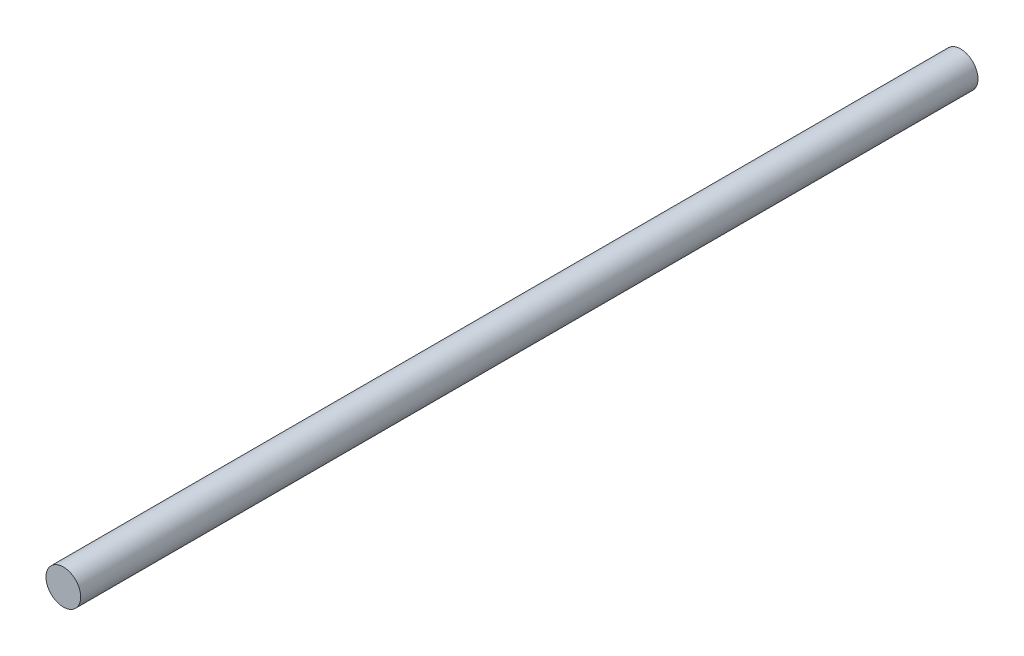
ISO-10303-21;
HEADER;
FILE_DESCRIPTION(('STEP AP214'),'2;1');
FILE_NAME('part.step','',(''),(''),'','','');
FILE_SCHEMA(('AUTOMOTIVE_DESIGN { 1 0 10303 214 1 1 1 1 }'));
ENDSEC;
DATA;
#1=APPLICATION_CONTEXT('core data for automotive mechanical design processes');
#2=APPLICATION_PROTOCOL_DEFINITION('international standard','automotive_design',2000,#1);
#3=PRODUCT_CONTEXT('',#1,'mechanical');
#4=PRODUCT('Part','Part','',(#3));
#5=PRODUCT_RELATED_PRODUCT_CATEGORY('part','',(#4));
#6=PRODUCT_DEFINITION_FORMATION('','',#4);
#7=PRODUCT_DEFINITION_CONTEXT('part definition',#1,'design');
#8=PRODUCT_DEFINITION('design','',#6,#7);
#9=PRODUCT_DEFINITION_SHAPE('','',#8);
#10=(LENGTH_UNIT() NAMED_UNIT(*) SI_UNIT(.MILLI.,.METRE.));
#11=(NAMED_UNIT(*) PLANE_ANGLE_UNIT() SI_UNIT($,.RADIAN.));
#12=(NAMED_UNIT(*) SI_UNIT($,.STERADIAN.) SOLID_ANGLE_UNIT());
#13=UNCERTAINTY_MEASURE_WITH_UNIT(LENGTH_MEASURE(1.E-05),#10,'distance_accuracy_value','');
#14=(GEOMETRIC_REPRESENTATION_CONTEXT(3) GLOBAL_UNCERTAINTY_ASSIGNED_CONTEXT((#13)) GLOBAL_UNIT_ASSIGNED_CONTEXT((#10,
#11,#12)) REPRESENTATION_CONTEXT('',''));
#15=CARTESIAN_POINT('',(0.,0.,0.));
#16=DIRECTION('',(0.,0.,1.));
#17=DIRECTION('',(1.,0.,0.));
#18=AXIS2_PLACEMENT_3D('',#15,#16,#17);
#19=CARTESIAN_POINT('',(0.,0.,-1550.));
#20=DIRECTION('',(0.,0.,1.));
#21=DIRECTION('',(1.,0.,0.));
#22=AXIS2_PLACEMENT_3D('',#19,#20,#21);
#23=CYLINDRICAL_SURFACE('',#22,30.);
#24=CARTESIAN_POINT('',(0.,0.,-1550.));
#25=DIRECTION('',(0.,0.,1.));
#26=DIRECTION('',(1.,0.,0.));
#27=AXIS2_PLACEMENT_3D('',#24,#25,#26);
#28=CIRCLE('',#27,30.);
#29=CARTESIAN_POINT('',(30.,0.,-1550.));
#30=VERTEX_POINT('',#29);
#31=EDGE_CURVE('E10',#30,#30,#28,.T.);
#32=ORIENTED_EDGE('',*,*,#31,.T.);
#33=EDGE_LOOP('',(#32));
#34=FACE_BOUND('',#33,.T.);
#35=CARTESIAN_POINT('',(0.,0.,0.));
#36=DIRECTION('',(0.,0.,1.));
#37=DIRECTION('',(1.,0.,0.));
#38=AXIS2_PLACEMENT_3D('',#35,#36,#37);
#39=CIRCLE('',#38,30.);
#40=CARTESIAN_POINT('',(30.,0.,0.));
#41=VERTEX_POINT('',#40);
#42=EDGE_CURVE('E40',#41,#41,#39,.T.);
#43=ORIENTED_EDGE('',*,*,#42,.F.);
#44=EDGE_LOOP('',(#43));
#45=FACE_BOUND('',#44,.T.);
#46=ADVANCED_FACE('F37',(#34,#45),#23,.T.);
#47=CARTESIAN_POINT('',(0.,0.,-1550.));
#48=DIRECTION('',(0.,0.,1.));
#49=DIRECTION('',(1.,0.,0.));
#50=AXIS2_PLACEMENT_3D('',#47,#48,#49);
#51=PLANE('',#50);
#52=ORIENTED_EDGE('',*,*,#31,.F.);
#53=EDGE_LOOP('',(#52));
#54=FACE_BOUND('',#53,.T.);
#55=ADVANCED_FACE('F54',(#54),#51,.F.);
#56=CARTESIAN_POINT('',(0.,0.,0.));
#57=DIRECTION('',(0.,0.,1.));
#58=DIRECTION('',(1.,0.,0.));
#59=AXIS2_PLACEMENT_3D('',#56,#57,#58);
#60=PLANE('',#59);
#61=ORIENTED_EDGE('',*,*,#42,.T.);
#62=EDGE_LOOP('',(#61));
#63=FACE_BOUND('',#62,.T.);
#64=ADVANCED_FACE('F51',(#63),#60,.T.);
#65=CLOSED_SHELL('',(#46,#55,#64));
#66=MANIFOLD_SOLID_BREP('B2',#65);
#67=ADVANCED_BREP_SHAPE_REPRESENTATION('',(#18,#66),#14);
#68=SHAPE_DEFINITION_REPRESENTATION(#9,#67);
ENDSEC;
END-ISO-10303-21;
